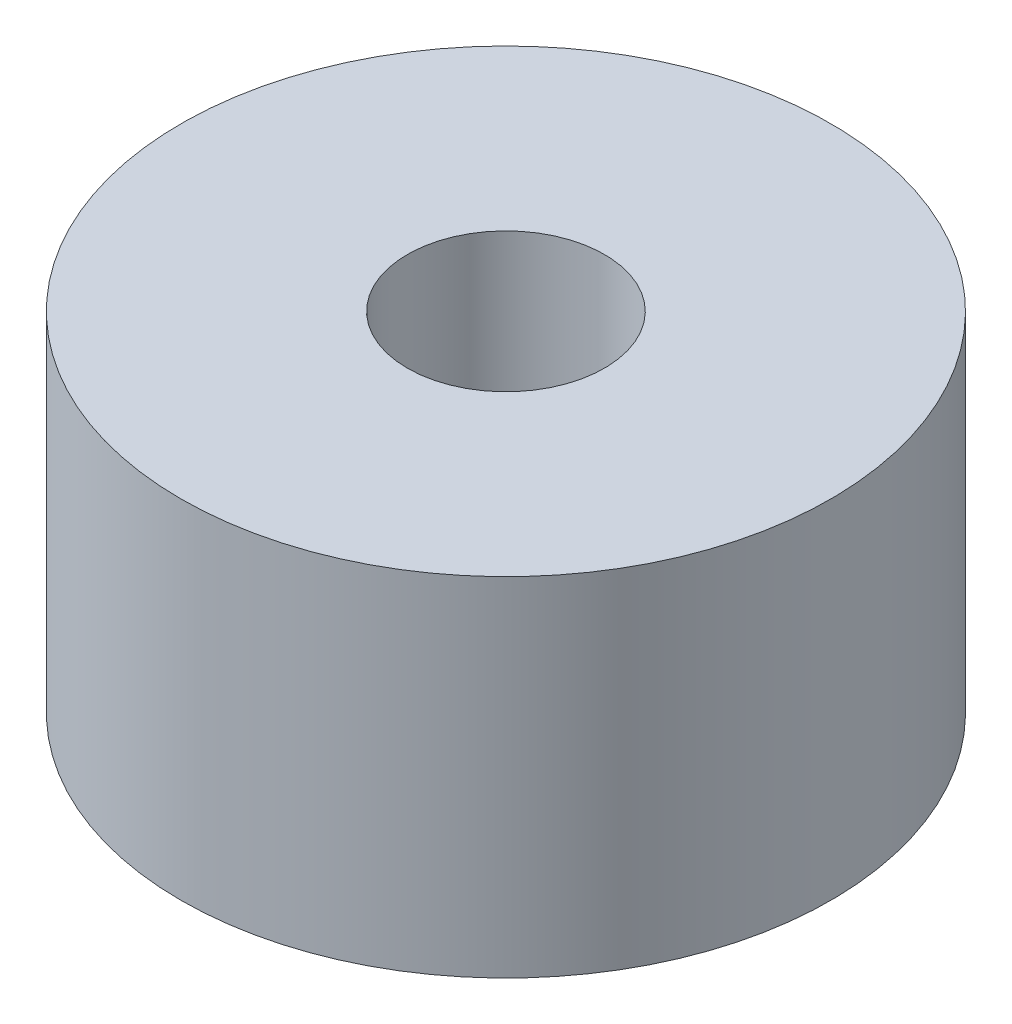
from build123d import *

# Parameters (mm, degrees)
SKETCH1_R      = 2.7305
SKETCH1_R_2    = 0.82804
EXTRUDE1_DEPTH = 2.921


with BuildPart() as part:
    # Sketch1 → Extrude1 (new body)
    with BuildSketch(Plane(origin=(0, 0, 0), x_dir=(1, 0, 0), z_dir=(0, 1, 0))):
        with Locations(Location((0, 0, 0), (0, 0, 270))):
            Circle(SKETCH1_R)
        with Locations(Location((0, 0, 0), (0, 0, 270))):
            Circle(SKETCH1_R_2, mode=Mode.SUBTRACT)
    extrude(amount=EXTRUDE1_DEPTH)


solid = part.part
